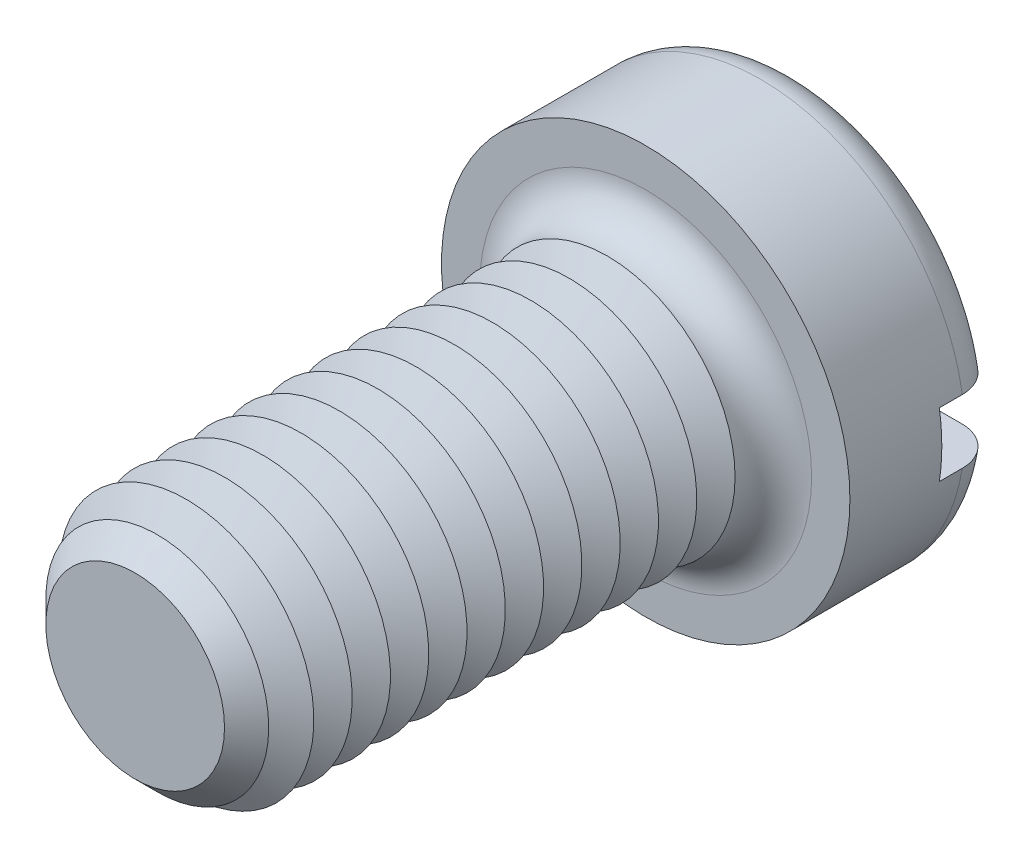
ISO-10303-21;
HEADER;
FILE_DESCRIPTION(('STEP AP214'),'2;1');
FILE_NAME('part.step','',(''),(''),'','','');
FILE_SCHEMA(('AUTOMOTIVE_DESIGN { 1 0 10303 214 1 1 1 1 }'));
ENDSEC;
DATA;
#1=APPLICATION_CONTEXT('core data for automotive mechanical design processes');
#2=APPLICATION_PROTOCOL_DEFINITION('international standard','automotive_design',2000,#1);
#3=PRODUCT_CONTEXT('',#1,'mechanical');
#4=PRODUCT('Part','Part','',(#3));
#5=PRODUCT_RELATED_PRODUCT_CATEGORY('part','',(#4));
#6=PRODUCT_DEFINITION_FORMATION('','',#4);
#7=PRODUCT_DEFINITION_CONTEXT('part definition',#1,'design');
#8=PRODUCT_DEFINITION('design','',#6,#7);
#9=PRODUCT_DEFINITION_SHAPE('','',#8);
#10=(LENGTH_UNIT() NAMED_UNIT(*) SI_UNIT(.MILLI.,.METRE.));
#11=(NAMED_UNIT(*) PLANE_ANGLE_UNIT() SI_UNIT($,.RADIAN.));
#12=(NAMED_UNIT(*) SI_UNIT($,.STERADIAN.) SOLID_ANGLE_UNIT());
#13=UNCERTAINTY_MEASURE_WITH_UNIT(LENGTH_MEASURE(1.E-05),#10,'distance_accuracy_value','');
#14=(GEOMETRIC_REPRESENTATION_CONTEXT(3) GLOBAL_UNCERTAINTY_ASSIGNED_CONTEXT((#13)) GLOBAL_UNIT_ASSIGNED_CONTEXT((#10,
#11,#12)) REPRESENTATION_CONTEXT('',''));
#15=CARTESIAN_POINT('',(0.,0.,0.));
#16=DIRECTION('',(0.,0.,1.));
#17=DIRECTION('',(1.,0.,0.));
#18=AXIS2_PLACEMENT_3D('',#15,#16,#17);
#19=CARTESIAN_POINT('',(0.,0.,-6.));
#20=DIRECTION('',(0.,0.,1.));
#21=DIRECTION('',(1.,0.,0.));
#22=AXIS2_PLACEMENT_3D('',#19,#20,#21);
#23=PLANE('',#22);
#24=CARTESIAN_POINT('',(0.,0.,-6.));
#25=DIRECTION('',(0.,0.,1.));
#26=DIRECTION('',(1.,0.,0.));
#27=AXIS2_PLACEMENT_3D('',#24,#25,#26);
#28=CIRCLE('',#27,6.5);
#29=CARTESIAN_POINT('',(-6.37867541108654,1.25,-6.));
#30=VERTEX_POINT('',#29);
#31=CARTESIAN_POINT('',(6.37867541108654,1.25,-6.));
#32=VERTEX_POINT('',#31);
#33=EDGE_CURVE('E116',#30,#32,#28,.F.);
#34=ORIENTED_EDGE('',*,*,#33,.T.);
#35=DIRECTION('',(1.,0.,0.));
#36=VECTOR('',#35,1.);
#37=CARTESIAN_POINT('',(-8.,1.25,-6.));
#38=LINE('',#37,#36);
#39=EDGE_CURVE('E111',#30,#32,#38,.T.);
#40=ORIENTED_EDGE('',*,*,#39,.F.);
#41=EDGE_LOOP('',(#34,#40));
#42=FACE_BOUND('',#41,.T.);
#43=ADVANCED_FACE('F39',(#42),#23,.F.);
#44=CARTESIAN_POINT('',(0.,0.,-4.5));
#45=DIRECTION('',(0.,0.,1.));
#46=DIRECTION('',(1.,0.,0.));
#47=AXIS2_PLACEMENT_3D('',#44,#45,#46);
#48=TOROIDAL_SURFACE('',#47,6.5,1.5);
#49=CARTESIAN_POINT('',(-7.63778128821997,1.25,-5.34492908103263));
#50=CARTESIAN_POINT('',(-7.58949199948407,1.25,-5.41482553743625));
#51=CARTESIAN_POINT('',(-7.53520056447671,1.25,-5.48065698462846));
#52=CARTESIAN_POINT('',(-7.41624971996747,1.25,-5.60228223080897));
#53=CARTESIAN_POINT('',(-7.35157642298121,1.25,-5.65806236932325));
#54=CARTESIAN_POINT('',(-7.21387612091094,1.25,-5.75795436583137));
#55=CARTESIAN_POINT('',(-7.14085828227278,1.25,-5.80207885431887));
#56=CARTESIAN_POINT('',(-6.98853766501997,1.25,-5.87758013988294));
#57=CARTESIAN_POINT('',(-6.90923642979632,1.25,-5.90896005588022));
#58=CARTESIAN_POINT('',(-6.74565677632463,1.25,-5.95849861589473));
#59=CARTESIAN_POINT('',(-6.66133328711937,1.25,-5.97650838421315));
#60=CARTESIAN_POINT('',(-6.49086565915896,1.25,-5.99833509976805));
#61=CARTESIAN_POINT('',(-6.40472129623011,1.25,-6.00215028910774));
#62=CARTESIAN_POINT('',(-6.23174891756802,1.25,-5.99550457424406));
#63=CARTESIAN_POINT('',(-6.14492874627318,1.25,-5.98483870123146));
#64=CARTESIAN_POINT('',(-5.97427268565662,1.25,-5.94920077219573));
#65=CARTESIAN_POINT('',(-5.89043699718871,1.25,-5.92422775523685));
#66=CARTESIAN_POINT('',(-5.72747580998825,1.25,-5.86041051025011));
#67=CARTESIAN_POINT('',(-5.64839123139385,1.25,-5.8214616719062));
#68=CARTESIAN_POINT('',(-5.49793182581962,1.25,-5.73076137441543));
#69=CARTESIAN_POINT('',(-5.42655700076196,1.25,-5.6790099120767));
#70=CARTESIAN_POINT('',(-5.29410028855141,1.25,-5.56444713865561));
#71=CARTESIAN_POINT('',(-5.23295591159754,1.25,-5.50170815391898));
#72=CARTESIAN_POINT('',(-5.12236155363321,1.25,-5.36664720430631));
#73=CARTESIAN_POINT('',(-5.07291010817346,1.25,-5.29432644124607));
#74=CARTESIAN_POINT('',(-4.98836421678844,1.25,-5.14389152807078));
#75=CARTESIAN_POINT('',(-4.95296843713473,1.25,-5.0659468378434));
#76=CARTESIAN_POINT('',(-4.89620356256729,1.25,-4.90510804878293));
#77=CARTESIAN_POINT('',(-4.87483169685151,1.25,-4.82221493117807));
#78=CARTESIAN_POINT('',(-4.8472995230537,1.25,-4.65636387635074));
#79=CARTESIAN_POINT('',(-4.84072446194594,1.25,-4.57347463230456));
#80=CARTESIAN_POINT('',(-4.84179430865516,1.25,-4.40779255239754));
#81=CARTESIAN_POINT('',(-4.84943782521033,1.25,-4.32499970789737));
#82=CARTESIAN_POINT('',(-4.87846819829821,1.25,-4.16301415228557));
#83=CARTESIAN_POINT('',(-4.89966978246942,1.25,-4.08378809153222));
#84=CARTESIAN_POINT('',(-4.95491528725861,1.25,-3.92995334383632));
#85=CARTESIAN_POINT('',(-4.98895983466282,1.25,-3.85534488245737));
#86=CARTESIAN_POINT('',(-5.06928242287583,1.25,-3.71183790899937));
#87=CARTESIAN_POINT('',(-5.11570495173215,1.25,-3.64302036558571));
#88=CARTESIAN_POINT('',(-5.21915370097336,1.25,-3.51388372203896));
#89=CARTESIAN_POINT('',(-5.27618132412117,1.25,-3.45356574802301));
#90=CARTESIAN_POINT('',(-5.40090076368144,1.25,-3.34137671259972));
#91=CARTESIAN_POINT('',(-5.46884305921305,1.25,-3.28978408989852));
#92=CARTESIAN_POINT('',(-5.61225757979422,1.25,-3.19841811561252));
#93=CARTESIAN_POINT('',(-5.68773079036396,1.25,-3.15864631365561));
#94=CARTESIAN_POINT('',(-5.84602026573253,1.25,-3.09111626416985));
#95=CARTESIAN_POINT('',(-5.92896901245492,1.25,-3.06366820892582));
#96=CARTESIAN_POINT('',(-6.09827849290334,1.25,-3.02294686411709));
#97=CARTESIAN_POINT('',(-6.18463944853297,1.25,-3.00967449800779));
#98=CARTESIAN_POINT('',(-6.35914138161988,1.25,-2.99765063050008));
#99=CARTESIAN_POINT('',(-6.4472913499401,1.25,-2.99902877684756));
#100=CARTESIAN_POINT('',(-6.62209547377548,1.25,-3.01665363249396));
#101=CARTESIAN_POINT('',(-6.70874965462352,1.25,-3.03290008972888));
#102=CARTESIAN_POINT('',(-6.87754008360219,1.25,-3.07975247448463));
#103=CARTESIAN_POINT('',(-6.95969991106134,1.25,-3.11027336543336));
#104=CARTESIAN_POINT('',(-7.11762200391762,1.25,-3.18486653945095));
#105=CARTESIAN_POINT('',(-7.19338469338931,1.25,-3.22893792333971));
#106=CARTESIAN_POINT('',(-7.33522754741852,1.25,-3.32873457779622));
#107=CARTESIAN_POINT('',(-7.40142768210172,1.25,-3.38428930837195));
#108=CARTESIAN_POINT('',(-7.52338344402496,1.25,-3.50587739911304));
#109=CARTESIAN_POINT('',(-7.5791399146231,1.25,-3.57190991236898));
#110=CARTESIAN_POINT('',(-7.67774856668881,1.25,-3.71151097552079));
#111=CARTESIAN_POINT('',(-7.72078137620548,1.25,-3.7849519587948));
#112=CARTESIAN_POINT('',(-7.79373860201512,1.25,-3.93807617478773));
#113=CARTESIAN_POINT('',(-7.82366445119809,1.25,-4.01775872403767));
#114=CARTESIAN_POINT('',(-7.86922494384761,1.25,-4.1801114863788));
#115=CARTESIAN_POINT('',(-7.88502105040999,1.25,-4.26273642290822));
#116=CARTESIAN_POINT('',(-7.90243332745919,1.25,-4.42948977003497));
#117=CARTESIAN_POINT('',(-7.90404643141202,1.25,-4.51361850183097));
#118=CARTESIAN_POINT('',(-7.89306914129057,1.25,-4.68049925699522));
#119=CARTESIAN_POINT('',(-7.88055163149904,1.25,-4.76325613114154));
#120=CARTESIAN_POINT('',(-7.84181179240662,1.25,-4.92542124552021));
#121=CARTESIAN_POINT('',(-7.81560657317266,1.25,-5.00483353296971));
#122=CARTESIAN_POINT('',(-7.76329893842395,1.25,-5.12766777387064));
#123=CARTESIAN_POINT('',(-7.74127773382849,1.25,-5.17287245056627));
#124=CARTESIAN_POINT('',(-7.69279783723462,1.25,-5.26083500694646));
#125=CARTESIAN_POINT('',(-7.66633917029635,1.25,-5.30359290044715));
#126=CARTESIAN_POINT('',(-7.63778128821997,1.25,-5.34492908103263));
#127=B_SPLINE_CURVE_WITH_KNOTS('',3,(#49,#50,#51,#52,#53,#54,#55,#56,#57,#58,#59,#60,#61,#62,
#63,#64,#65,#66,#67,#68,#69,#70,#71,#72,#73,#74,#75,#76,#77,#78,#79,#80,#81,#82,#83,#84,#85,#86,
#87,#88,#89,#90,#91,#92,#93,#94,#95,#96,#97,#98,#99,#100,#101,#102,#103,#104,#105,#106,#107,
#108,#109,#110,#111,#112,#113,#114,#115,#116,#117,#118,#119,#120,#121,#122,#123,#124,#125,#126),
.UNSPECIFIED.,.T.,.F.,(4,2,2,2,2,2,2,2,2,2,2,2,2,2,2,2,2,2,2,2,2,2,2,2,2,2,2,2,2,2,2,2,2,2,2,2,
2,2,4),(0.,0.254678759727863,0.509701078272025,0.764445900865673,1.01912834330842,
1.27660578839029,1.53411511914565,1.7953075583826,2.05651754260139,2.31972495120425,
2.58293242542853,2.84446831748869,3.10597143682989,3.36151874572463,3.61701554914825,
3.86525656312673,4.11347328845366,4.35836855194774,4.60327576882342,4.8511774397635,
5.0991119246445,5.35387584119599,5.60867314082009,5.86956650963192,6.13047687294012,
6.39369803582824,6.65691473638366,6.91858297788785,7.18023385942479,7.43824706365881,
7.69623942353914,7.95037087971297,8.20447454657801,8.45563599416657,8.70685174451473,
8.95677764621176,9.20639187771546,9.35700761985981,9.50762251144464),.UNSPECIFIED.);
#128=CARTESIAN_POINT('',(-7.90174031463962,1.25,-4.50000000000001));
#129=VERTEX_POINT('',#128);
#130=EDGE_CURVE('E281',#129,#30,#127,.T.);
#131=ORIENTED_EDGE('',*,*,#130,.F.);
#132=CARTESIAN_POINT('',(0.,0.,-4.5));
#133=DIRECTION('',(0.,0.,1.));
#134=DIRECTION('',(1.,0.,0.));
#135=AXIS2_PLACEMENT_3D('',#132,#133,#134);
#136=CIRCLE('',#135,8.);
#137=CARTESIAN_POINT('',(7.90174031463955,1.25,-4.5));
#138=VERTEX_POINT('',#137);
#139=EDGE_CURVE('E125',#138,#129,#136,.T.);
#140=ORIENTED_EDGE('',*,*,#139,.F.);
#141=CARTESIAN_POINT('',(4.95236709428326,1.25,-5.05808354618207));
#142=CARTESIAN_POINT('',(4.98477386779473,1.25,-5.13646278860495));
#143=CARTESIAN_POINT('',(5.02397623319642,1.25,-5.21210974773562));
#144=CARTESIAN_POINT('',(5.11464829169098,1.25,-5.35575180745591));
#145=CARTESIAN_POINT('',(5.16613670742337,1.25,-5.42373499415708));
#146=CARTESIAN_POINT('',(5.27963080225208,1.25,-5.55005899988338));
#147=CARTESIAN_POINT('',(5.34161871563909,1.25,-5.60841578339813));
#148=CARTESIAN_POINT('',(5.47431803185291,1.25,-5.71412381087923));
#149=CARTESIAN_POINT('',(5.545027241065,1.25,-5.76147781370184));
#150=CARTESIAN_POINT('',(5.69469818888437,1.25,-5.84486022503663));
#151=CARTESIAN_POINT('',(5.77379661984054,1.25,-5.88064336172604));
#152=CARTESIAN_POINT('',(5.93682776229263,1.25,-5.93863952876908));
#153=CARTESIAN_POINT('',(6.02076112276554,1.25,-5.96085073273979));
#154=CARTESIAN_POINT('',(6.19235911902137,1.25,-5.99130732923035));
#155=CARTESIAN_POINT('',(6.2800597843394,1.25,-5.99935025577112));
#156=CARTESIAN_POINT('',(6.45556807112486,1.25,-6.00057400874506));
#157=CARTESIAN_POINT('',(6.54337569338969,1.25,-5.99375472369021));
#158=CARTESIAN_POINT('',(6.71642471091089,1.25,-5.96539034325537));
#159=CARTESIAN_POINT('',(6.8016703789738,1.25,-5.94387137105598));
#160=CARTESIAN_POINT('',(6.96726399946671,1.25,-5.8866508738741));
#161=CARTESIAN_POINT('',(7.04761223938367,1.25,-5.85095018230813));
#162=CARTESIAN_POINT('',(7.2000703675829,1.25,-5.7668235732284));
#163=CARTESIAN_POINT('',(7.27226868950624,1.25,-5.71855796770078));
#164=CARTESIAN_POINT('',(7.40737382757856,1.25,-5.61041520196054));
#165=CARTESIAN_POINT('',(7.47028138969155,1.25,-5.55053897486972));
#166=CARTESIAN_POINT('',(7.5840004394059,1.25,-5.42185995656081));
#167=CARTESIAN_POINT('',(7.63498189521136,1.25,-5.35320736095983));
#168=CARTESIAN_POINT('',(7.72451646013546,1.25,-5.20822613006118));
#169=CARTESIAN_POINT('',(7.76307051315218,1.25,-5.13189807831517));
#170=CARTESIAN_POINT('',(7.82615156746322,1.25,-4.97479919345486));
#171=CARTESIAN_POINT('',(7.85085353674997,1.25,-4.89409858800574));
#172=CARTESIAN_POINT('',(7.88624162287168,1.25,-4.72968126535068));
#173=CARTESIAN_POINT('',(7.89692844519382,1.25,-4.64596470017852));
#174=CARTESIAN_POINT('',(7.90393395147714,1.25,-4.47857496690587));
#175=CARTESIAN_POINT('',(7.900361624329,1.25,-4.39490633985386));
#176=CARTESIAN_POINT('',(7.8792027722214,1.25,-4.22936201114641));
#177=CARTESIAN_POINT('',(7.86161649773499,1.25,-4.14748627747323));
#178=CARTESIAN_POINT('',(7.81298565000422,1.25,-3.98793539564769));
#179=CARTESIAN_POINT('',(7.78195585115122,1.25,-3.91025574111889));
#180=CARTESIAN_POINT('',(7.70736418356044,1.25,-3.76116938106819));
#181=CARTESIAN_POINT('',(7.66380211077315,1.25,-3.68976277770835));
#182=CARTESIAN_POINT('',(7.56515173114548,1.25,-3.55480889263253));
#183=CARTESIAN_POINT('',(7.51000119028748,1.25,-3.49130712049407));
#184=CARTESIAN_POINT('',(7.38992820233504,1.25,-3.3743390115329));
#185=CARTESIAN_POINT('',(7.32500529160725,1.25,-3.32087315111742));
#186=CARTESIAN_POINT('',(7.18646521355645,1.25,-3.22483712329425));
#187=CARTESIAN_POINT('',(7.11275872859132,1.25,-3.18239583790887));
#188=CARTESIAN_POINT('',(6.95934489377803,1.25,-3.11028530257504));
#189=CARTESIAN_POINT('',(6.87963710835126,1.25,-3.08061698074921));
#190=CARTESIAN_POINT('',(6.71523243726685,1.25,-3.03442872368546));
#191=CARTESIAN_POINT('',(6.63047940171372,1.25,-3.0181086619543));
#192=CARTESIAN_POINT('',(6.45944163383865,1.25,-2.99971307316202));
#193=CARTESIAN_POINT('',(6.37315677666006,1.25,-2.99763871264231));
#194=CARTESIAN_POINT('',(6.20021063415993,1.25,-3.00779604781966));
#195=CARTESIAN_POINT('',(6.11356117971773,1.25,-3.02022976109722));
#196=CARTESIAN_POINT('',(5.94354092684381,1.25,-3.05935975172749));
#197=CARTESIAN_POINT('',(5.86017035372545,1.25,-3.08605700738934));
#198=CARTESIAN_POINT('',(5.69848536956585,1.25,-3.15322746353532));
#199=CARTESIAN_POINT('',(5.62021039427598,1.25,-3.1937956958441));
#200=CARTESIAN_POINT('',(5.47164170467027,1.25,-3.28758816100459));
#201=CARTESIAN_POINT('',(5.40134797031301,1.25,-3.3408123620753));
#202=CARTESIAN_POINT('',(5.27136483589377,1.25,-3.45806317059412));
#203=CARTESIAN_POINT('',(5.21160120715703,1.25,-3.52200740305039));
#204=CARTESIAN_POINT('',(5.10396941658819,1.25,-3.65922833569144));
#205=CARTESIAN_POINT('',(5.05609917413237,1.25,-3.73250340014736));
#206=CARTESIAN_POINT('',(4.97487058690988,1.25,-3.8844714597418));
#207=CARTESIAN_POINT('',(4.94119529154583,1.25,-3.96299495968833));
#208=CARTESIAN_POINT('',(4.88793322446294,1.25,-4.12470694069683));
#209=CARTESIAN_POINT('',(4.86834741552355,1.25,-4.20789574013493));
#210=CARTESIAN_POINT('',(4.84433446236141,1.25,-4.3740749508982));
#211=CARTESIAN_POINT('',(4.83950391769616,1.25,-4.45700748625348));
#212=CARTESIAN_POINT('',(4.84404021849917,1.25,-4.62240731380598));
#213=CARTESIAN_POINT('',(4.85338770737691,1.25,-4.70487508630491));
#214=CARTESIAN_POINT('',(4.87895619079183,1.25,-4.83246978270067));
#215=CARTESIAN_POINT('',(4.89056704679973,1.25,-4.87856970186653));
#216=CARTESIAN_POINT('',(4.91819711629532,1.25,-4.96942661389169));
#217=CARTESIAN_POINT('',(4.93421619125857,1.25,-5.01418364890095));
#218=CARTESIAN_POINT('',(4.95236709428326,1.25,-5.05808354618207));
#219=B_SPLINE_CURVE_WITH_KNOTS('',3,(#141,#142,#143,#144,#145,#146,#147,#148,#149,#150,#151,
#152,#153,#154,#155,#156,#157,#158,#159,#160,#161,#162,#163,#164,#165,#166,#167,#168,#169,#170,
#171,#172,#173,#174,#175,#176,#177,#178,#179,#180,#181,#182,#183,#184,#185,#186,#187,#188,#189,
#190,#191,#192,#193,#194,#195,#196,#197,#198,#199,#200,#201,#202,#203,#204,#205,#206,#207,#208,
#209,#210,#211,#212,#213,#214,#215,#216,#217,#218),.UNSPECIFIED.,.T.,.F.,(4,2,2,2,2,2,2,2,2,2,2,
2,2,2,2,2,2,2,2,2,2,2,2,2,2,2,2,2,2,2,2,2,2,2,2,2,2,2,4),(0.,0.25426396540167,0.508917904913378,
0.763145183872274,1.01730864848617,1.27655188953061,1.53583000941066,1.79878406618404,
2.06174009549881,2.32423003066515,2.5867045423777,2.84598168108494,3.10523799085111,
3.36053725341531,3.61581712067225,3.8677953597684,4.11976091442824,4.36980428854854,
4.61984319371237,4.86960800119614,5.11937687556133,5.37052303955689,5.62168112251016,
5.87565515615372,6.12964764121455,6.38737709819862,6.64512765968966,6.90651052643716,
7.16791132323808,7.43114013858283,7.69436829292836,7.95565940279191,8.21690477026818,
8.47196060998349,8.72703387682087,8.97506819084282,9.22276418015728,9.36518087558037,
9.50759309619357),.UNSPECIFIED.);
#220=EDGE_CURVE('E283',#32,#138,#219,.T.);
#221=ORIENTED_EDGE('',*,*,#220,.F.);
#222=ORIENTED_EDGE('',*,*,#33,.F.);
#223=EDGE_LOOP('',(#131,#140,#221,#222));
#224=FACE_BOUND('',#223,.T.);
#225=ADVANCED_FACE('F265',(#224),#48,.T.);
#226=CARTESIAN_POINT('',(0.,0.,-6.));
#227=DIRECTION('',(0.,0.,1.));
#228=DIRECTION('',(1.,0.,0.));
#229=AXIS2_PLACEMENT_3D('',#226,#227,#228);
#230=CYLINDRICAL_SURFACE('',#229,8.);
#231=DIRECTION('',(0.,0.,1.));
#232=VECTOR('',#231,1.);
#233=CARTESIAN_POINT('',(7.90174031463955,1.25,-6.));
#234=LINE('',#233,#232);
#235=CARTESIAN_POINT('',(7.90174031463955,1.25,-3.6));
#236=VERTEX_POINT('',#235);
#237=EDGE_CURVE('E299',#138,#236,#234,.T.);
#238=ORIENTED_EDGE('',*,*,#237,.F.);
#239=ORIENTED_EDGE('',*,*,#139,.T.);
#240=DIRECTION('',(0.,0.,1.));
#241=VECTOR('',#240,1.);
#242=CARTESIAN_POINT('',(-7.90174031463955,1.25,-6.));
#243=LINE('',#242,#241);
#244=CARTESIAN_POINT('',(-7.90174031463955,1.25,-3.6));
#245=VERTEX_POINT('',#244);
#246=EDGE_CURVE('E63',#245,#129,#243,.F.);
#247=ORIENTED_EDGE('',*,*,#246,.F.);
#248=CARTESIAN_POINT('',(0.,0.,-3.6));
#249=DIRECTION('',(0.,0.,-1.));
#250=DIRECTION('',(-1.,0.,0.));
#251=AXIS2_PLACEMENT_3D('',#248,#249,#250);
#252=CIRCLE('',#251,8.);
#253=CARTESIAN_POINT('',(-7.90174031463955,-1.25,-3.6));
#254=VERTEX_POINT('',#253);
#255=EDGE_CURVE('E43',#245,#254,#252,.F.);
#256=ORIENTED_EDGE('',*,*,#255,.T.);
#257=DIRECTION('',(0.,0.,1.));
#258=VECTOR('',#257,1.);
#259=CARTESIAN_POINT('',(-7.90174031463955,-1.25,-6.));
#260=LINE('',#259,#258);
#261=CARTESIAN_POINT('',(-7.9017403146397,-1.25,-4.49999999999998));
#262=VERTEX_POINT('',#261);
#263=EDGE_CURVE('E296',#262,#254,#260,.T.);
#264=ORIENTED_EDGE('',*,*,#263,.F.);
#265=CARTESIAN_POINT('',(7.90174031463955,-1.25,-4.5));
#266=VERTEX_POINT('',#265);
#267=EDGE_CURVE('E127',#262,#266,#136,.T.);
#268=ORIENTED_EDGE('',*,*,#267,.T.);
#269=DIRECTION('',(0.,0.,1.));
#270=VECTOR('',#269,1.);
#271=CARTESIAN_POINT('',(7.90174031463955,-1.25,-6.));
#272=LINE('',#271,#270);
#273=CARTESIAN_POINT('',(7.90174031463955,-1.25,-3.6));
#274=VERTEX_POINT('',#273);
#275=EDGE_CURVE('E55',#274,#266,#272,.F.);
#276=ORIENTED_EDGE('',*,*,#275,.F.);
#277=EDGE_CURVE('E11',#274,#236,#252,.F.);
#278=ORIENTED_EDGE('',*,*,#277,.T.);
#279=EDGE_LOOP('',(#238,#239,#247,#256,#264,#268,#276,#278));
#280=FACE_BOUND('',#279,.T.);
#281=CARTESIAN_POINT('',(0.,0.,0.));
#282=DIRECTION('',(0.,0.,1.));
#283=DIRECTION('',(1.,0.,0.));
#284=AXIS2_PLACEMENT_3D('',#281,#282,#283);
#285=CIRCLE('',#284,8.);
#286=CARTESIAN_POINT('',(8.,0.,0.));
#287=VERTEX_POINT('',#286);
#288=EDGE_CURVE('E302',#287,#287,#285,.T.);
#289=ORIENTED_EDGE('',*,*,#288,.F.);
#290=EDGE_LOOP('',(#289));
#291=FACE_BOUND('',#290,.T.);
#292=ADVANCED_FACE('F261',(#280,#291),#230,.T.);
#293=CARTESIAN_POINT('',(6.37867541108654,-1.25,-6.));
#294=VERTEX_POINT('',#293);
#295=CARTESIAN_POINT('',(-6.37867541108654,-1.25,-6.));
#296=VERTEX_POINT('',#295);
#297=EDGE_CURVE('E109',#294,#296,#28,.F.);
#298=ORIENTED_EDGE('',*,*,#297,.T.);
#299=DIRECTION('',(-1.,0.,0.));
#300=VECTOR('',#299,1.);
#301=CARTESIAN_POINT('',(-8.,-1.25,-6.));
#302=LINE('',#301,#300);
#303=EDGE_CURVE('E96',#294,#296,#302,.T.);
#304=ORIENTED_EDGE('',*,*,#303,.F.);
#305=EDGE_LOOP('',(#298,#304));
#306=FACE_BOUND('',#305,.T.);
#307=ADVANCED_FACE('F108',(#306),#23,.F.);
#308=CARTESIAN_POINT('',(0.,0.,0.));
#309=DIRECTION('',(0.,0.,1.));
#310=DIRECTION('',(1.,0.,0.));
#311=AXIS2_PLACEMENT_3D('',#308,#309,#310);
#312=PLANE('',#311);
#313=CARTESIAN_POINT('',(0.,0.,0.));
#314=DIRECTION('',(0.,0.,1.));
#315=DIRECTION('',(1.,0.,0.));
#316=AXIS2_PLACEMENT_3D('',#313,#314,#315);
#317=CIRCLE('',#316,6.5);
#318=CARTESIAN_POINT('',(6.5,0.,0.));
#319=VERTEX_POINT('',#318);
#320=EDGE_CURVE('E115',#319,#319,#317,.F.);
#321=ORIENTED_EDGE('',*,*,#320,.T.);
#322=EDGE_LOOP('',(#321));
#323=FACE_BOUND('',#322,.T.);
#324=ORIENTED_EDGE('',*,*,#288,.T.);
#325=EDGE_LOOP('',(#324));
#326=FACE_BOUND('',#325,.T.);
#327=ADVANCED_FACE('F260',(#323,#326),#312,.T.);
#328=CARTESIAN_POINT('',(-7.63778128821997,-1.25,-5.34492908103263));
#329=CARTESIAN_POINT('',(-7.68527581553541,-1.25,-5.27616964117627));
#330=CARTESIAN_POINT('',(-7.72703224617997,-1.25,-5.20337764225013));
#331=CARTESIAN_POINT('',(-7.79778035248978,-1.25,-5.05176511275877));
#332=CARTESIAN_POINT('',(-7.82675823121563,-1.25,-4.97293817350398));
#333=CARTESIAN_POINT('',(-7.87103239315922,-1.25,-4.81153865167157));
#334=CARTESIAN_POINT('',(-7.8863313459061,-1.25,-4.72896680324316));
#335=CARTESIAN_POINT('',(-7.90278562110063,-1.25,-4.56244566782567));
#336=CARTESIAN_POINT('',(-7.90394420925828,-1.25,-4.4784967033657));
#337=CARTESIAN_POINT('',(-7.89211470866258,-1.25,-4.31190980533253));
#338=CARTESIAN_POINT('',(-7.87917806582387,-1.25,-4.22926821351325));
#339=CARTESIAN_POINT('',(-7.8396278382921,-1.25,-4.06732477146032));
#340=CARTESIAN_POINT('',(-7.81301388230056,-1.25,-3.98802301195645));
#341=CARTESIAN_POINT('',(-7.74686575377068,-1.25,-3.83490116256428));
#342=CARTESIAN_POINT('',(-7.70731700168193,-1.25,-3.76108737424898));
#343=CARTESIAN_POINT('',(-7.61647675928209,-1.25,-3.62108231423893));
#344=CARTESIAN_POINT('',(-7.56518496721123,-1.25,-3.55489123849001));
#345=CARTESIAN_POINT('',(-7.45192141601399,-1.25,-3.43145488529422));
#346=CARTESIAN_POINT('',(-7.3898717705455,-1.25,-3.37428109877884));
#347=CARTESIAN_POINT('',(-7.25715883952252,-1.25,-3.27100737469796));
#348=CARTESIAN_POINT('',(-7.18649507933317,-1.25,-3.22490804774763));
#349=CARTESIAN_POINT('',(-7.03760898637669,-1.25,-3.14445316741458));
#350=CARTESIAN_POINT('',(-6.95930204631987,-1.25,-3.1102542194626));
#351=CARTESIAN_POINT('',(-6.79811453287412,-1.25,-3.05526915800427));
#352=CARTESIAN_POINT('',(-6.71523359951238,-1.25,-3.03448410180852));
#353=CARTESIAN_POINT('',(-6.5459165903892,-1.25,-3.006592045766));
#354=CARTESIAN_POINT('',(-6.45944575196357,-1.25,-2.99969602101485));
#355=CARTESIAN_POINT('',(-6.28655568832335,-1.25,-3.00032465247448));
#356=CARTESIAN_POINT('',(-6.20013646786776,-1.25,-3.00785047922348));
#357=CARTESIAN_POINT('',(-6.02865505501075,-1.25,-3.03725742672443));
#358=CARTESIAN_POINT('',(-5.94362352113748,-1.25,-3.05931758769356));
#359=CARTESIAN_POINT('',(-5.77844448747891,-1.25,-3.11735373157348));
#360=CARTESIAN_POINT('',(-5.69829723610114,-1.25,-3.15333042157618));
#361=CARTESIAN_POINT('',(-5.54495924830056,-1.25,-3.23837037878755));
#362=CARTESIAN_POINT('',(-5.47178958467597,-1.25,-3.28747168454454));
#363=CARTESIAN_POINT('',(-5.33486536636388,-1.25,-3.39741183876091));
#364=CARTESIAN_POINT('',(-5.27111040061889,-1.25,-3.45825017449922));
#365=CARTESIAN_POINT('',(-5.15579778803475,-1.25,-3.58914722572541));
#366=CARTESIAN_POINT('',(-5.10409113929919,-1.25,-3.65907455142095));
#367=CARTESIAN_POINT('',(-5.01353659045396,-1.25,-3.8068142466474));
#368=CARTESIAN_POINT('',(-4.97468647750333,-1.25,-3.88462525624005));
#369=CARTESIAN_POINT('',(-4.91208858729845,-1.25,-4.04366636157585));
#370=CARTESIAN_POINT('',(-4.88795969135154,-1.25,-4.12474643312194));
#371=CARTESIAN_POINT('',(-4.85404909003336,-1.25,-4.28985038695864));
#372=CARTESIAN_POINT('',(-4.84426486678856,-1.25,-4.37387374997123));
#373=CARTESIAN_POINT('',(-4.83946276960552,-1.25,-4.54023897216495));
#374=CARTESIAN_POINT('',(-4.8440833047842,-1.25,-4.62257060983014));
#375=CARTESIAN_POINT('',(-4.86713763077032,-1.25,-4.78527148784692));
#376=CARTESIAN_POINT('',(-4.88557092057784,-1.25,-4.86564079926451));
#377=CARTESIAN_POINT('',(-4.9355229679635,-1.25,-5.02189555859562));
#378=CARTESIAN_POINT('',(-4.9669975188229,-1.25,-5.09779517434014));
#379=CARTESIAN_POINT('',(-5.04199393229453,-1.25,-5.24338322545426));
#380=CARTESIAN_POINT('',(-5.0855168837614,-1.25,-5.31307109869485));
#381=CARTESIAN_POINT('',(-5.18427540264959,-1.25,-5.44580979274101));
#382=CARTESIAN_POINT('',(-5.2397318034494,-1.25,-5.50869620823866));
#383=CARTESIAN_POINT('',(-5.36015301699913,-1.25,-5.62458635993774));
#384=CARTESIAN_POINT('',(-5.42511919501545,-1.25,-5.67758867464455));
#385=CARTESIAN_POINT('',(-5.56469412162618,-1.25,-5.7737610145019));
#386=CARTESIAN_POINT('',(-5.6395232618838,-1.25,-5.81661133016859));
#387=CARTESIAN_POINT('',(-5.79521544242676,-1.25,-5.8894110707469));
#388=CARTESIAN_POINT('',(-5.8760791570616,-1.25,-5.91935905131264));
#389=CARTESIAN_POINT('',(-6.04317815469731,-1.25,-5.9660059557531));
#390=CARTESIAN_POINT('',(-6.12948555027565,-1.25,-5.98244700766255));
#391=CARTESIAN_POINT('',(-6.30363462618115,-1.25,-6.00064866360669));
#392=CARTESIAN_POINT('',(-6.39147629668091,-1.25,-6.00240936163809));
#393=CARTESIAN_POINT('',(-6.5664192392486,-1.25,-5.9911248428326));
#394=CARTESIAN_POINT('',(-6.653518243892,-1.25,-5.9780442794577));
#395=CARTESIAN_POINT('',(-6.82426167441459,-1.25,-5.93729204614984));
#396=CARTESIAN_POINT('',(-6.90790538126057,-1.25,-5.90961735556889));
#397=CARTESIAN_POINT('',(-7.06846412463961,-1.25,-5.84071272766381));
#398=CARTESIAN_POINT('',(-7.14543542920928,-1.25,-5.79961377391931));
#399=CARTESIAN_POINT('',(-7.29116896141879,-1.25,-5.70491210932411));
#400=CARTESIAN_POINT('',(-7.35994165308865,-1.25,-5.65132560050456));
#401=CARTESIAN_POINT('',(-7.46362894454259,-1.25,-5.55509815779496));
#402=CARTESIAN_POINT('',(-7.50165191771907,-1.25,-5.51575032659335));
#403=CARTESIAN_POINT('',(-7.57319530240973,-1.25,-5.43315308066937));
#404=CARTESIAN_POINT('',(-7.60671575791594,-1.25,-5.38990370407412));
#405=CARTESIAN_POINT('',(-7.63778128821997,-1.25,-5.34492908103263));
#406=B_SPLINE_CURVE_WITH_KNOTS('',3,(#328,#329,#330,#331,#332,#333,#334,#335,#336,#337,#338,
#339,#340,#341,#342,#343,#344,#345,#346,#347,#348,#349,#350,#351,#352,#353,#354,#355,#356,#357,
#358,#359,#360,#361,#362,#363,#364,#365,#366,#367,#368,#369,#370,#371,#372,#373,#374,#375,#376,
#377,#378,#379,#380,#381,#382,#383,#384,#385,#386,#387,#388,#389,#390,#391,#392,#393,#394,#395,
#396,#397,#398,#399,#400,#401,#402,#403,#404,#405),.UNSPECIFIED.,.T.,.F.,(4,2,2,2,2,2,2,2,2,2,2,
2,2,2,2,2,2,2,2,2,2,2,2,2,2,2,2,2,2,2,2,2,2,2,2,2,2,2,4),(0.,0.250506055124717,
0.501281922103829,0.752008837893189,1.00267784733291,1.25243500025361,1.50219893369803,
1.75224536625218,2.00229822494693,2.25424343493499,2.50620253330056,2.76136198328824,
3.01654154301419,3.27556891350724,3.53461730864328,3.79691797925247,4.05923197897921,
4.32231463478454,4.5853858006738,4.84500678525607,5.10458306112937,5.3571172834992,
5.60960717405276,5.85581050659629,6.10200490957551,6.34737151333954,6.59276029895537,
6.84315522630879,7.09358613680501,7.35108485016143,7.60861238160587,7.87094926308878,
8.13328446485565,8.39624576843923,8.65926152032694,8.91978401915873,9.17997036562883,
9.34382460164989,9.50767723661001),.UNSPECIFIED.);
#407=EDGE_CURVE('E103',#296,#262,#406,.T.);
#408=ORIENTED_EDGE('',*,*,#407,.F.);
#409=ORIENTED_EDGE('',*,*,#297,.F.);
#410=CARTESIAN_POINT('',(4.95236709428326,-1.25,-5.05808354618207));
#411=CARTESIAN_POINT('',(4.92105512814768,-1.25,-4.98233216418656));
#412=CARTESIAN_POINT('',(4.89604361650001,-1.25,-4.90392040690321));
#413=CARTESIAN_POINT('',(4.85951223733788,-1.25,-4.74395758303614));
#414=CARTESIAN_POINT('',(4.8480045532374,-1.25,-4.66240375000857));
#415=CARTESIAN_POINT('',(4.83891469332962,-1.25,-4.49852199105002));
#416=CARTESIAN_POINT('',(4.84133145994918,-1.25,-4.41619412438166));
#417=CARTESIAN_POINT('',(4.8600038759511,-1.25,-4.25314313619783));
#418=CARTESIAN_POINT('',(4.87625705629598,-1.25,-4.17241973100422));
#419=CARTESIAN_POINT('',(4.92196554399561,-1.25,-4.01505032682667));
#420=CARTESIAN_POINT('',(4.95138456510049,-1.25,-3.93839376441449));
#421=CARTESIAN_POINT('',(5.02244158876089,-1.25,-3.79097367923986));
#422=CARTESIAN_POINT('',(5.06408092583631,-1.25,-3.72021080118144));
#423=CARTESIAN_POINT('',(5.15918188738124,-1.25,-3.5851203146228));
#424=CARTESIAN_POINT('',(5.21285223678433,-1.25,-3.5209397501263));
#425=CARTESIAN_POINT('',(5.32993512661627,-1.25,-3.40218700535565));
#426=CARTESIAN_POINT('',(5.39334903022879,-1.25,-3.34761617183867));
#427=CARTESIAN_POINT('',(5.5300552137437,-1.25,-3.24801679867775));
#428=CARTESIAN_POINT('',(5.60357647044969,-1.25,-3.20330242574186));
#429=CARTESIAN_POINT('',(5.75697062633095,-1.25,-3.1265687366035));
#430=CARTESIAN_POINT('',(5.83684424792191,-1.25,-3.09455086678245));
#431=CARTESIAN_POINT('',(6.00239031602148,-1.25,-3.04353393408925));
#432=CARTESIAN_POINT('',(6.08814636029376,-1.25,-3.02480570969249));
#433=CARTESIAN_POINT('',(6.26158564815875,-1.25,-3.00194915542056));
#434=CARTESIAN_POINT('',(6.34926896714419,-1.25,-2.997821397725));
#435=CARTESIAN_POINT('',(6.52441816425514,-1.25,-3.00435236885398));
#436=CARTESIAN_POINT('',(6.61188199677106,-1.25,-3.01506655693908));
#437=CARTESIAN_POINT('',(6.78373130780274,-1.25,-3.05116556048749));
#438=CARTESIAN_POINT('',(6.8681168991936,-1.25,-3.07654983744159));
#439=CARTESIAN_POINT('',(7.03056473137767,-1.25,-3.14105639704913));
#440=CARTESIAN_POINT('',(7.10867812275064,-1.25,-3.18004978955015));
#441=CARTESIAN_POINT('',(7.25711285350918,-1.25,-3.27078804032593));
#442=CARTESIAN_POINT('',(7.327434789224,-1.25,-3.32253192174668));
#443=CARTESIAN_POINT('',(7.45716954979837,-1.25,-3.4364775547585));
#444=CARTESIAN_POINT('',(7.51672925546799,-1.25,-3.49851206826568));
#445=CARTESIAN_POINT('',(7.62440498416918,-1.25,-3.63182557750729));
#446=CARTESIAN_POINT('',(7.67252193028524,-1.25,-3.70310382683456));
#447=CARTESIAN_POINT('',(7.75523498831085,-1.25,-3.8517825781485));
#448=CARTESIAN_POINT('',(7.79001407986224,-1.25,-3.92908131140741));
#449=CARTESIAN_POINT('',(7.84595474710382,-1.25,-4.08845836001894));
#450=CARTESIAN_POINT('',(7.86711715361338,-1.25,-4.1705363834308));
#451=CARTESIAN_POINT('',(7.89503817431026,-1.25,-4.3362768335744));
#452=CARTESIAN_POINT('',(7.90193595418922,-1.25,-4.41991584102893));
#453=CARTESIAN_POINT('',(7.90153623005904,-1.25,-4.58715860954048));
#454=CARTESIAN_POINT('',(7.89423915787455,-1.25,-4.67076237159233));
#455=CARTESIAN_POINT('',(7.86572271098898,-1.25,-4.83525080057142));
#456=CARTESIAN_POINT('',(7.84455307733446,-1.25,-4.91614410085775));
#457=CARTESIAN_POINT('',(7.78897430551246,-1.25,-5.0732444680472));
#458=CARTESIAN_POINT('',(7.75456511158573,-1.25,-5.1494515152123));
#459=CARTESIAN_POINT('',(7.67339923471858,-1.25,-5.29528903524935));
#460=CARTESIAN_POINT('',(7.62660424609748,-1.25,-5.36489817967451));
#461=CARTESIAN_POINT('',(7.52209201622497,-1.25,-5.49536318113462));
#462=CARTESIAN_POINT('',(7.4643743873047,-1.25,-5.55621872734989));
#463=CARTESIAN_POINT('',(7.33909994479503,-1.25,-5.66807257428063));
#464=CARTESIAN_POINT('',(7.27145672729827,-1.25,-5.71897407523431));
#465=CARTESIAN_POINT('',(7.12868060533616,-1.25,-5.80887807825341));
#466=CARTESIAN_POINT('',(7.0535472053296,-1.25,-5.84787979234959));
#467=CARTESIAN_POINT('',(6.89682225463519,-1.25,-5.91345911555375));
#468=CARTESIAN_POINT('',(6.81515596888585,-1.25,-5.93985808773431));
#469=CARTESIAN_POINT('',(6.64858434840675,-1.25,-5.97879449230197));
#470=CARTESIAN_POINT('',(6.56367874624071,-1.25,-5.99133077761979));
#471=CARTESIAN_POINT('',(6.39168259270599,-1.25,-6.00236627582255));
#472=CARTESIAN_POINT('',(6.30457835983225,-1.25,-6.00065255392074));
#473=CARTESIAN_POINT('',(6.13186422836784,-1.25,-5.98278857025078));
#474=CARTESIAN_POINT('',(6.04625438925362,-1.25,-5.96663773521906));
#475=CARTESIAN_POINT('',(5.87802521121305,-1.25,-5.92012173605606));
#476=CARTESIAN_POINT('',(5.79544617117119,-1.25,-5.88961066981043));
#477=CARTESIAN_POINT('',(5.63656223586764,-1.25,-5.81513349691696));
#478=CARTESIAN_POINT('',(5.56025908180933,-1.25,-5.77116367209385));
#479=CARTESIAN_POINT('',(5.4162607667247,-1.25,-5.67098882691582));
#480=CARTESIAN_POINT('',(5.34855795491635,-1.25,-5.61479480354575));
#481=CARTESIAN_POINT('',(5.22382615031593,-1.25,-5.49168804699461));
#482=CARTESIAN_POINT('',(5.16678340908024,-1.25,-5.42478932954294));
#483=CARTESIAN_POINT('',(5.08326589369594,-1.25,-5.3075481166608));
#484=CARTESIAN_POINT('',(5.05313168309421,-1.25,-5.25976959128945));
#485=CARTESIAN_POINT('',(4.99845900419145,-1.25,-5.16110869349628));
#486=CARTESIAN_POINT('',(4.9739204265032,-1.25,-5.11022638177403));
#487=CARTESIAN_POINT('',(4.95236709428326,-1.25,-5.05808354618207));
#488=B_SPLINE_CURVE_WITH_KNOTS('',3,(#410,#411,#412,#413,#414,#415,#416,#417,#418,#419,#420,
#421,#422,#423,#424,#425,#426,#427,#428,#429,#430,#431,#432,#433,#434,#435,#436,#437,#438,#439,
#440,#441,#442,#443,#444,#445,#446,#447,#448,#449,#450,#451,#452,#453,#454,#455,#456,#457,#458,
#459,#460,#461,#462,#463,#464,#465,#466,#467,#468,#469,#470,#471,#472,#473,#474,#475,#476,#477,
#478,#479,#480,#481,#482,#483,#484,#485,#486,#487),.UNSPECIFIED.,.T.,.F.,(4,2,2,2,2,2,2,2,2,2,2,
2,2,2,2,2,2,2,2,2,2,2,2,2,2,2,2,2,2,2,2,2,2,2,2,2,2,2,4),(0.,0.245701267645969,
0.491624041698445,0.737528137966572,0.983388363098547,1.22857510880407,1.47378864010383,
1.72364048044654,1.97352730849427,2.2304941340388,2.48749022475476,2.74958408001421,
3.01168820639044,3.2747743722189,3.53785088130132,3.79850056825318,4.05913029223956,
4.31587819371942,4.57260537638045,4.82567253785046,5.07872425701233,5.32929532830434,
5.57985877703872,5.82952869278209,6.07919966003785,6.32965199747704,6.58011322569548,
6.8329006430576,7.08570479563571,7.3419930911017,7.59830259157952,7.85844887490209,
8.11860548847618,8.38146435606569,8.64439590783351,8.90709189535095,9.16944670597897,
9.33857644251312,9.5077028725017),.UNSPECIFIED.);
#489=EDGE_CURVE('E92',#266,#294,#488,.T.);
#490=ORIENTED_EDGE('',*,*,#489,.F.);
#491=ORIENTED_EDGE('',*,*,#267,.F.);
#492=EDGE_LOOP('',(#408,#409,#490,#491));
#493=FACE_BOUND('',#492,.T.);
#494=ADVANCED_FACE('F113',(#493),#48,.T.);
#495=CARTESIAN_POINT('',(0.,0.,1.5));
#496=DIRECTION('',(0.,0.,1.));
#497=DIRECTION('',(1.,0.,0.));
#498=AXIS2_PLACEMENT_3D('',#495,#496,#497);
#499=TOROIDAL_SURFACE('',#498,6.5,1.5);
#500=ORIENTED_EDGE('',*,*,#320,.F.);
#501=EDGE_LOOP('',(#500));
#502=FACE_BOUND('',#501,.T.);
#503=CARTESIAN_POINT('',(0.,0.,1.5));
#504=DIRECTION('',(0.,0.,-1.));
#505=DIRECTION('',(-1.,0.,0.));
#506=AXIS2_PLACEMENT_3D('',#503,#504,#505);
#507=CIRCLE('',#506,5.);
#508=CARTESIAN_POINT('',(-5.,0.,1.5));
#509=VERTEX_POINT('',#508);
#510=EDGE_CURVE('E306',#509,#509,#507,.T.);
#511=ORIENTED_EDGE('',*,*,#510,.T.);
#512=EDGE_LOOP('',(#511));
#513=FACE_BOUND('',#512,.T.);
#514=ADVANCED_FACE('F253',(#502,#513),#499,.F.);
#515=CARTESIAN_POINT('',(0.,0.,2.25));
#516=DIRECTION('',(0.,0.,-1.));
#517=DIRECTION('',(-1.,0.,0.));
#518=AXIS2_PLACEMENT_3D('',#515,#516,#517);
#519=CONICAL_SURFACE('',#518,3.70096189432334,1.0471975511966);
#520=ORIENTED_EDGE('',*,*,#510,.F.);
#521=EDGE_LOOP('',(#520));
#522=FACE_BOUND('',#521,.T.);
#523=CARTESIAN_POINT('',(0.,0.,2.25));
#524=DIRECTION('',(0.,0.,-1.));
#525=DIRECTION('',(-1.,0.,0.));
#526=AXIS2_PLACEMENT_3D('',#523,#524,#525);
#527=CIRCLE('',#526,3.70096189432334);
#528=CARTESIAN_POINT('',(-3.70096189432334,0.,2.25));
#529=VERTEX_POINT('',#528);
#530=EDGE_CURVE('E312',#529,#529,#527,.T.);
#531=ORIENTED_EDGE('',*,*,#530,.T.);
#532=EDGE_LOOP('',(#531));
#533=FACE_BOUND('',#532,.T.);
#534=ADVANCED_FACE('F249',(#522,#533),#519,.T.);
#535=CARTESIAN_POINT('',(0.,0.,3.));
#536=DIRECTION('',(0.,0.,1.));
#537=DIRECTION('',(1.,0.,0.));
#538=AXIS2_PLACEMENT_3D('',#535,#536,#537);
#539=CONICAL_SURFACE('',#538,5.,1.0471975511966);
#540=ORIENTED_EDGE('',*,*,#530,.F.);
#541=EDGE_LOOP('',(#540));
#542=FACE_BOUND('',#541,.T.);
#543=CARTESIAN_POINT('',(0.,0.,3.));
#544=DIRECTION('',(0.,0.,-1.));
#545=DIRECTION('',(-1.,0.,0.));
#546=AXIS2_PLACEMENT_3D('',#543,#544,#545);
#547=CIRCLE('',#546,5.);
#548=CARTESIAN_POINT('',(-5.,0.,3.));
#549=VERTEX_POINT('',#548);
#550=EDGE_CURVE('E318',#549,#549,#547,.T.);
#551=ORIENTED_EDGE('',*,*,#550,.T.);
#552=EDGE_LOOP('',(#551));
#553=FACE_BOUND('',#552,.T.);
#554=ADVANCED_FACE('F245',(#542,#553),#539,.T.);
#555=CARTESIAN_POINT('',(0.,0.,3.75));
#556=DIRECTION('',(0.,0.,-1.));
#557=DIRECTION('',(-1.,0.,0.));
#558=AXIS2_PLACEMENT_3D('',#555,#556,#557);
#559=CONICAL_SURFACE('',#558,3.70096189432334,1.0471975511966);
#560=ORIENTED_EDGE('',*,*,#550,.F.);
#561=EDGE_LOOP('',(#560));
#562=FACE_BOUND('',#561,.T.);
#563=CARTESIAN_POINT('',(0.,0.,3.75));
#564=DIRECTION('',(0.,0.,-1.));
#565=DIRECTION('',(-1.,0.,0.));
#566=AXIS2_PLACEMENT_3D('',#563,#564,#565);
#567=CIRCLE('',#566,3.70096189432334);
#568=CARTESIAN_POINT('',(-3.70096189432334,0.,3.75));
#569=VERTEX_POINT('',#568);
#570=EDGE_CURVE('E322',#569,#569,#567,.T.);
#571=ORIENTED_EDGE('',*,*,#570,.T.);
#572=EDGE_LOOP('',(#571));
#573=FACE_BOUND('',#572,.T.);
#574=ADVANCED_FACE('F241',(#562,#573),#559,.T.);
#575=CARTESIAN_POINT('',(0.,0.,4.5));
#576=DIRECTION('',(0.,0.,1.));
#577=DIRECTION('',(1.,0.,0.));
#578=AXIS2_PLACEMENT_3D('',#575,#576,#577);
#579=CONICAL_SURFACE('',#578,5.,1.0471975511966);
#580=ORIENTED_EDGE('',*,*,#570,.F.);
#581=EDGE_LOOP('',(#580));
#582=FACE_BOUND('',#581,.T.);
#583=CARTESIAN_POINT('',(0.,0.,4.5));
#584=DIRECTION('',(0.,0.,-1.));
#585=DIRECTION('',(-1.,0.,0.));
#586=AXIS2_PLACEMENT_3D('',#583,#584,#585);
#587=CIRCLE('',#586,5.);
#588=CARTESIAN_POINT('',(-5.,0.,4.5));
#589=VERTEX_POINT('',#588);
#590=EDGE_CURVE('E325',#589,#589,#587,.T.);
#591=ORIENTED_EDGE('',*,*,#590,.T.);
#592=EDGE_LOOP('',(#591));
#593=FACE_BOUND('',#592,.T.);
#594=ADVANCED_FACE('F237',(#582,#593),#579,.T.);
#595=CARTESIAN_POINT('',(0.,0.,5.25));
#596=DIRECTION('',(0.,0.,-1.));
#597=DIRECTION('',(-1.,0.,0.));
#598=AXIS2_PLACEMENT_3D('',#595,#596,#597);
#599=CONICAL_SURFACE('',#598,3.70096189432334,1.0471975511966);
#600=ORIENTED_EDGE('',*,*,#590,.F.);
#601=EDGE_LOOP('',(#600));
#602=FACE_BOUND('',#601,.T.);
#603=CARTESIAN_POINT('',(0.,0.,5.25));
#604=DIRECTION('',(0.,0.,-1.));
#605=DIRECTION('',(-1.,0.,0.));
#606=AXIS2_PLACEMENT_3D('',#603,#604,#605);
#607=CIRCLE('',#606,3.70096189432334);
#608=CARTESIAN_POINT('',(-3.70096189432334,0.,5.25));
#609=VERTEX_POINT('',#608);
#610=EDGE_CURVE('E329',#609,#609,#607,.T.);
#611=ORIENTED_EDGE('',*,*,#610,.T.);
#612=EDGE_LOOP('',(#611));
#613=FACE_BOUND('',#612,.T.);
#614=ADVANCED_FACE('F233',(#602,#613),#599,.T.);
#615=CARTESIAN_POINT('',(0.,0.,6.));
#616=DIRECTION('',(0.,0.,1.));
#617=DIRECTION('',(1.,0.,0.));
#618=AXIS2_PLACEMENT_3D('',#615,#616,#617);
#619=CONICAL_SURFACE('',#618,5.,1.0471975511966);
#620=ORIENTED_EDGE('',*,*,#610,.F.);
#621=EDGE_LOOP('',(#620));
#622=FACE_BOUND('',#621,.T.);
#623=CARTESIAN_POINT('',(0.,0.,6.));
#624=DIRECTION('',(0.,0.,-1.));
#625=DIRECTION('',(-1.,0.,0.));
#626=AXIS2_PLACEMENT_3D('',#623,#624,#625);
#627=CIRCLE('',#626,5.);
#628=CARTESIAN_POINT('',(-5.,0.,6.));
#629=VERTEX_POINT('',#628);
#630=EDGE_CURVE('E333',#629,#629,#627,.T.);
#631=ORIENTED_EDGE('',*,*,#630,.T.);
#632=EDGE_LOOP('',(#631));
#633=FACE_BOUND('',#632,.T.);
#634=ADVANCED_FACE('F229',(#622,#633),#619,.T.);
#635=CARTESIAN_POINT('',(0.,0.,6.75));
#636=DIRECTION('',(0.,0.,-1.));
#637=DIRECTION('',(-1.,0.,0.));
#638=AXIS2_PLACEMENT_3D('',#635,#636,#637);
#639=CONICAL_SURFACE('',#638,3.70096189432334,1.0471975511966);
#640=ORIENTED_EDGE('',*,*,#630,.F.);
#641=EDGE_LOOP('',(#640));
#642=FACE_BOUND('',#641,.T.);
#643=CARTESIAN_POINT('',(0.,0.,6.75));
#644=DIRECTION('',(0.,0.,-1.));
#645=DIRECTION('',(-1.,0.,0.));
#646=AXIS2_PLACEMENT_3D('',#643,#644,#645);
#647=CIRCLE('',#646,3.70096189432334);
#648=CARTESIAN_POINT('',(-3.70096189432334,0.,6.75));
#649=VERTEX_POINT('',#648);
#650=EDGE_CURVE('E337',#649,#649,#647,.T.);
#651=ORIENTED_EDGE('',*,*,#650,.T.);
#652=EDGE_LOOP('',(#651));
#653=FACE_BOUND('',#652,.T.);
#654=ADVANCED_FACE('F225',(#642,#653),#639,.T.);
#655=CARTESIAN_POINT('',(0.,0.,7.5));
#656=DIRECTION('',(0.,0.,1.));
#657=DIRECTION('',(1.,0.,0.));
#658=AXIS2_PLACEMENT_3D('',#655,#656,#657);
#659=CONICAL_SURFACE('',#658,5.,1.0471975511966);
#660=ORIENTED_EDGE('',*,*,#650,.F.);
#661=EDGE_LOOP('',(#660));
#662=FACE_BOUND('',#661,.T.);
#663=CARTESIAN_POINT('',(0.,0.,7.5));
#664=DIRECTION('',(0.,0.,-1.));
#665=DIRECTION('',(-1.,0.,0.));
#666=AXIS2_PLACEMENT_3D('',#663,#664,#665);
#667=CIRCLE('',#666,5.);
#668=CARTESIAN_POINT('',(-5.,0.,7.5));
#669=VERTEX_POINT('',#668);
#670=EDGE_CURVE('E340',#669,#669,#667,.T.);
#671=ORIENTED_EDGE('',*,*,#670,.T.);
#672=EDGE_LOOP('',(#671));
#673=FACE_BOUND('',#672,.T.);
#674=ADVANCED_FACE('F221',(#662,#673),#659,.T.);
#675=CARTESIAN_POINT('',(0.,0.,8.25));
#676=DIRECTION('',(0.,0.,-1.));
#677=DIRECTION('',(-1.,0.,0.));
#678=AXIS2_PLACEMENT_3D('',#675,#676,#677);
#679=CONICAL_SURFACE('',#678,3.70096189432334,1.0471975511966);
#680=ORIENTED_EDGE('',*,*,#670,.F.);
#681=EDGE_LOOP('',(#680));
#682=FACE_BOUND('',#681,.T.);
#683=CARTESIAN_POINT('',(0.,0.,8.25));
#684=DIRECTION('',(0.,0.,-1.));
#685=DIRECTION('',(-1.,0.,0.));
#686=AXIS2_PLACEMENT_3D('',#683,#684,#685);
#687=CIRCLE('',#686,3.70096189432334);
#688=CARTESIAN_POINT('',(-3.70096189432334,0.,8.25));
#689=VERTEX_POINT('',#688);
#690=EDGE_CURVE('E344',#689,#689,#687,.T.);
#691=ORIENTED_EDGE('',*,*,#690,.T.);
#692=EDGE_LOOP('',(#691));
#693=FACE_BOUND('',#692,.T.);
#694=ADVANCED_FACE('F217',(#682,#693),#679,.T.);
#695=CARTESIAN_POINT('',(0.,0.,9.));
#696=DIRECTION('',(0.,0.,1.));
#697=DIRECTION('',(1.,0.,0.));
#698=AXIS2_PLACEMENT_3D('',#695,#696,#697);
#699=CONICAL_SURFACE('',#698,5.,1.0471975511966);
#700=ORIENTED_EDGE('',*,*,#690,.F.);
#701=EDGE_LOOP('',(#700));
#702=FACE_BOUND('',#701,.T.);
#703=CARTESIAN_POINT('',(0.,0.,9.));
#704=DIRECTION('',(0.,0.,-1.));
#705=DIRECTION('',(-1.,0.,0.));
#706=AXIS2_PLACEMENT_3D('',#703,#704,#705);
#707=CIRCLE('',#706,5.);
#708=CARTESIAN_POINT('',(-5.,0.,9.));
#709=VERTEX_POINT('',#708);
#710=EDGE_CURVE('E348',#709,#709,#707,.T.);
#711=ORIENTED_EDGE('',*,*,#710,.T.);
#712=EDGE_LOOP('',(#711));
#713=FACE_BOUND('',#712,.T.);
#714=ADVANCED_FACE('F213',(#702,#713),#699,.T.);
#715=CARTESIAN_POINT('',(0.,0.,9.75));
#716=DIRECTION('',(0.,0.,-1.));
#717=DIRECTION('',(-1.,0.,0.));
#718=AXIS2_PLACEMENT_3D('',#715,#716,#717);
#719=CONICAL_SURFACE('',#718,3.70096189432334,1.0471975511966);
#720=ORIENTED_EDGE('',*,*,#710,.F.);
#721=EDGE_LOOP('',(#720));
#722=FACE_BOUND('',#721,.T.);
#723=CARTESIAN_POINT('',(0.,0.,9.75));
#724=DIRECTION('',(0.,0.,-1.));
#725=DIRECTION('',(-1.,0.,0.));
#726=AXIS2_PLACEMENT_3D('',#723,#724,#725);
#727=CIRCLE('',#726,3.70096189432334);
#728=CARTESIAN_POINT('',(-3.70096189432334,0.,9.75));
#729=VERTEX_POINT('',#728);
#730=EDGE_CURVE('E351',#729,#729,#727,.T.);
#731=ORIENTED_EDGE('',*,*,#730,.T.);
#732=EDGE_LOOP('',(#731));
#733=FACE_BOUND('',#732,.T.);
#734=ADVANCED_FACE('F209',(#722,#733),#719,.T.);
#735=CARTESIAN_POINT('',(0.,0.,10.5));
#736=DIRECTION('',(0.,0.,1.));
#737=DIRECTION('',(1.,0.,0.));
#738=AXIS2_PLACEMENT_3D('',#735,#736,#737);
#739=CONICAL_SURFACE('',#738,5.,1.0471975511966);
#740=ORIENTED_EDGE('',*,*,#730,.F.);
#741=EDGE_LOOP('',(#740));
#742=FACE_BOUND('',#741,.T.);
#743=CARTESIAN_POINT('',(0.,0.,10.5));
#744=DIRECTION('',(0.,0.,-1.));
#745=DIRECTION('',(-1.,0.,0.));
#746=AXIS2_PLACEMENT_3D('',#743,#744,#745);
#747=CIRCLE('',#746,5.);
#748=CARTESIAN_POINT('',(-5.,0.,10.5));
#749=VERTEX_POINT('',#748);
#750=EDGE_CURVE('E355',#749,#749,#747,.T.);
#751=ORIENTED_EDGE('',*,*,#750,.T.);
#752=EDGE_LOOP('',(#751));
#753=FACE_BOUND('',#752,.T.);
#754=ADVANCED_FACE('F205',(#742,#753),#739,.T.);
#755=CARTESIAN_POINT('',(0.,0.,11.25));
#756=DIRECTION('',(0.,0.,-1.));
#757=DIRECTION('',(-1.,0.,0.));
#758=AXIS2_PLACEMENT_3D('',#755,#756,#757);
#759=CONICAL_SURFACE('',#758,3.70096189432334,1.0471975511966);
#760=ORIENTED_EDGE('',*,*,#750,.F.);
#761=EDGE_LOOP('',(#760));
#762=FACE_BOUND('',#761,.T.);
#763=CARTESIAN_POINT('',(0.,0.,11.25));
#764=DIRECTION('',(0.,0.,-1.));
#765=DIRECTION('',(-1.,0.,0.));
#766=AXIS2_PLACEMENT_3D('',#763,#764,#765);
#767=CIRCLE('',#766,3.70096189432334);
#768=CARTESIAN_POINT('',(-3.70096189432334,0.,11.25));
#769=VERTEX_POINT('',#768);
#770=EDGE_CURVE('E359',#769,#769,#767,.T.);
#771=ORIENTED_EDGE('',*,*,#770,.T.);
#772=EDGE_LOOP('',(#771));
#773=FACE_BOUND('',#772,.T.);
#774=ADVANCED_FACE('F201',(#762,#773),#759,.T.);
#775=CARTESIAN_POINT('',(0.,0.,12.));
#776=DIRECTION('',(0.,0.,1.));
#777=DIRECTION('',(1.,0.,0.));
#778=AXIS2_PLACEMENT_3D('',#775,#776,#777);
#779=CONICAL_SURFACE('',#778,5.,1.0471975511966);
#780=ORIENTED_EDGE('',*,*,#770,.F.);
#781=EDGE_LOOP('',(#780));
#782=FACE_BOUND('',#781,.T.);
#783=CARTESIAN_POINT('',(0.,0.,12.));
#784=DIRECTION('',(0.,0.,-1.));
#785=DIRECTION('',(-1.,0.,0.));
#786=AXIS2_PLACEMENT_3D('',#783,#784,#785);
#787=CIRCLE('',#786,5.);
#788=CARTESIAN_POINT('',(-5.,0.,12.));
#789=VERTEX_POINT('',#788);
#790=EDGE_CURVE('E363',#789,#789,#787,.T.);
#791=ORIENTED_EDGE('',*,*,#790,.T.);
#792=EDGE_LOOP('',(#791));
#793=FACE_BOUND('',#792,.T.);
#794=ADVANCED_FACE('F197',(#782,#793),#779,.T.);
#795=CARTESIAN_POINT('',(0.,0.,12.75));
#796=DIRECTION('',(0.,0.,-1.));
#797=DIRECTION('',(-1.,0.,0.));
#798=AXIS2_PLACEMENT_3D('',#795,#796,#797);
#799=CONICAL_SURFACE('',#798,3.70096189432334,1.0471975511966);
#800=ORIENTED_EDGE('',*,*,#790,.F.);
#801=EDGE_LOOP('',(#800));
#802=FACE_BOUND('',#801,.T.);
#803=CARTESIAN_POINT('',(0.,0.,12.75));
#804=DIRECTION('',(0.,0.,-1.));
#805=DIRECTION('',(-1.,0.,0.));
#806=AXIS2_PLACEMENT_3D('',#803,#804,#805);
#807=CIRCLE('',#806,3.70096189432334);
#808=CARTESIAN_POINT('',(-3.70096189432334,0.,12.75));
#809=VERTEX_POINT('',#808);
#810=EDGE_CURVE('E367',#809,#809,#807,.T.);
#811=ORIENTED_EDGE('',*,*,#810,.T.);
#812=EDGE_LOOP('',(#811));
#813=FACE_BOUND('',#812,.T.);
#814=ADVANCED_FACE('F193',(#802,#813),#799,.T.);
#815=CARTESIAN_POINT('',(0.,0.,13.5));
#816=DIRECTION('',(0.,0.,1.));
#817=DIRECTION('',(1.,0.,0.));
#818=AXIS2_PLACEMENT_3D('',#815,#816,#817);
#819=CONICAL_SURFACE('',#818,5.,1.0471975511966);
#820=ORIENTED_EDGE('',*,*,#810,.F.);
#821=EDGE_LOOP('',(#820));
#822=FACE_BOUND('',#821,.T.);
#823=CARTESIAN_POINT('',(0.,0.,13.5));
#824=DIRECTION('',(0.,0.,-1.));
#825=DIRECTION('',(-1.,0.,0.));
#826=AXIS2_PLACEMENT_3D('',#823,#824,#825);
#827=CIRCLE('',#826,5.);
#828=CARTESIAN_POINT('',(-5.,0.,13.5));
#829=VERTEX_POINT('',#828);
#830=EDGE_CURVE('E370',#829,#829,#827,.T.);
#831=ORIENTED_EDGE('',*,*,#830,.T.);
#832=EDGE_LOOP('',(#831));
#833=FACE_BOUND('',#832,.T.);
#834=ADVANCED_FACE('F189',(#822,#833),#819,.T.);
#835=CARTESIAN_POINT('',(0.,0.,14.25));
#836=DIRECTION('',(0.,0.,-1.));
#837=DIRECTION('',(-1.,0.,0.));
#838=AXIS2_PLACEMENT_3D('',#835,#836,#837);
#839=CONICAL_SURFACE('',#838,3.70096189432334,1.0471975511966);
#840=ORIENTED_EDGE('',*,*,#830,.F.);
#841=EDGE_LOOP('',(#840));
#842=FACE_BOUND('',#841,.T.);
#843=CARTESIAN_POINT('',(0.,0.,14.25));
#844=DIRECTION('',(0.,0.,-1.));
#845=DIRECTION('',(-1.,0.,0.));
#846=AXIS2_PLACEMENT_3D('',#843,#844,#845);
#847=CIRCLE('',#846,3.70096189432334);
#848=CARTESIAN_POINT('',(-3.70096189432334,0.,14.25));
#849=VERTEX_POINT('',#848);
#850=EDGE_CURVE('E374',#849,#849,#847,.T.);
#851=ORIENTED_EDGE('',*,*,#850,.T.);
#852=EDGE_LOOP('',(#851));
#853=FACE_BOUND('',#852,.T.);
#854=ADVANCED_FACE('F185',(#842,#853),#839,.T.);
#855=CARTESIAN_POINT('',(0.,0.,15.));
#856=DIRECTION('',(0.,0.,1.));
#857=DIRECTION('',(1.,0.,0.));
#858=AXIS2_PLACEMENT_3D('',#855,#856,#857);
#859=CONICAL_SURFACE('',#858,5.,1.0471975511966);
#860=ORIENTED_EDGE('',*,*,#850,.F.);
#861=EDGE_LOOP('',(#860));
#862=FACE_BOUND('',#861,.T.);
#863=CARTESIAN_POINT('',(0.,0.,15.));
#864=DIRECTION('',(0.,0.,-1.));
#865=DIRECTION('',(-1.,0.,0.));
#866=AXIS2_PLACEMENT_3D('',#863,#864,#865);
#867=CIRCLE('',#866,5.);
#868=CARTESIAN_POINT('',(-5.,0.,15.));
#869=VERTEX_POINT('',#868);
#870=EDGE_CURVE('E378',#869,#869,#867,.T.);
#871=ORIENTED_EDGE('',*,*,#870,.T.);
#872=EDGE_LOOP('',(#871));
#873=FACE_BOUND('',#872,.T.);
#874=ADVANCED_FACE('F181',(#862,#873),#859,.T.);
#875=CARTESIAN_POINT('',(0.,0.,15.75));
#876=DIRECTION('',(0.,0.,-1.));
#877=DIRECTION('',(-1.,0.,0.));
#878=AXIS2_PLACEMENT_3D('',#875,#876,#877);
#879=CONICAL_SURFACE('',#878,3.70096189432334,1.0471975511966);
#880=ORIENTED_EDGE('',*,*,#870,.F.);
#881=EDGE_LOOP('',(#880));
#882=FACE_BOUND('',#881,.T.);
#883=CARTESIAN_POINT('',(0.,0.,15.75));
#884=DIRECTION('',(0.,0.,-1.));
#885=DIRECTION('',(-1.,0.,0.));
#886=AXIS2_PLACEMENT_3D('',#883,#884,#885);
#887=CIRCLE('',#886,3.70096189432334);
#888=CARTESIAN_POINT('',(-3.70096189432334,0.,15.75));
#889=VERTEX_POINT('',#888);
#890=EDGE_CURVE('E382',#889,#889,#887,.T.);
#891=ORIENTED_EDGE('',*,*,#890,.T.);
#892=EDGE_LOOP('',(#891));
#893=FACE_BOUND('',#892,.T.);
#894=ADVANCED_FACE('F177',(#882,#893),#879,.T.);
#895=CARTESIAN_POINT('',(0.,0.,16.5));
#896=DIRECTION('',(0.,0.,1.));
#897=DIRECTION('',(1.,0.,0.));
#898=AXIS2_PLACEMENT_3D('',#895,#896,#897);
#899=CONICAL_SURFACE('',#898,5.,1.0471975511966);
#900=ORIENTED_EDGE('',*,*,#890,.F.);
#901=EDGE_LOOP('',(#900));
#902=FACE_BOUND('',#901,.T.);
#903=CARTESIAN_POINT('',(0.,0.,16.5));
#904=DIRECTION('',(0.,0.,-1.));
#905=DIRECTION('',(-1.,0.,0.));
#906=AXIS2_PLACEMENT_3D('',#903,#904,#905);
#907=CIRCLE('',#906,5.);
#908=CARTESIAN_POINT('',(-5.,0.,16.5));
#909=VERTEX_POINT('',#908);
#910=EDGE_CURVE('E386',#909,#909,#907,.T.);
#911=ORIENTED_EDGE('',*,*,#910,.T.);
#912=EDGE_LOOP('',(#911));
#913=FACE_BOUND('',#912,.T.);
#914=ADVANCED_FACE('F173',(#902,#913),#899,.T.);
#915=CARTESIAN_POINT('',(0.,0.,17.25));
#916=DIRECTION('',(0.,0.,-1.));
#917=DIRECTION('',(-1.,0.,0.));
#918=AXIS2_PLACEMENT_3D('',#915,#916,#917);
#919=CONICAL_SURFACE('',#918,3.70096189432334,1.0471975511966);
#920=ORIENTED_EDGE('',*,*,#910,.F.);
#921=EDGE_LOOP('',(#920));
#922=FACE_BOUND('',#921,.T.);
#923=CARTESIAN_POINT('',(0.,0.,17.25));
#924=DIRECTION('',(0.,0.,-1.));
#925=DIRECTION('',(-1.,0.,0.));
#926=AXIS2_PLACEMENT_3D('',#923,#924,#925);
#927=CIRCLE('',#926,3.70096189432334);
#928=CARTESIAN_POINT('',(-3.70096189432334,0.,17.25));
#929=VERTEX_POINT('',#928);
#930=EDGE_CURVE('E136',#929,#929,#927,.T.);
#931=ORIENTED_EDGE('',*,*,#930,.T.);
#932=EDGE_LOOP('',(#931));
#933=FACE_BOUND('',#932,.T.);
#934=ADVANCED_FACE('F169',(#922,#933),#919,.T.);
#935=CARTESIAN_POINT('',(0.,0.,18.));
#936=DIRECTION('',(0.,0.,1.));
#937=DIRECTION('',(1.,0.,0.));
#938=AXIS2_PLACEMENT_3D('',#935,#936,#937);
#939=CONICAL_SURFACE('',#938,5.,1.0471975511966);
#940=ORIENTED_EDGE('',*,*,#930,.F.);
#941=EDGE_LOOP('',(#940));
#942=FACE_BOUND('',#941,.T.);
#943=CARTESIAN_POINT('',(0.,0.,18.));
#944=DIRECTION('',(0.,0.,-1.));
#945=DIRECTION('',(-1.,0.,0.));
#946=AXIS2_PLACEMENT_3D('',#943,#944,#945);
#947=CIRCLE('',#946,5.);
#948=CARTESIAN_POINT('',(-5.,0.,18.));
#949=VERTEX_POINT('',#948);
#950=EDGE_CURVE('E137',#949,#949,#947,.T.);
#951=ORIENTED_EDGE('',*,*,#950,.T.);
#952=EDGE_LOOP('',(#951));
#953=FACE_BOUND('',#952,.T.);
#954=ADVANCED_FACE('F165',(#942,#953),#939,.T.);
#955=CARTESIAN_POINT('',(0.,0.,18.75));
#956=DIRECTION('',(0.,0.,-1.));
#957=DIRECTION('',(-1.,0.,0.));
#958=AXIS2_PLACEMENT_3D('',#955,#956,#957);
#959=CONICAL_SURFACE('',#958,3.70096189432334,1.0471975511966);
#960=ORIENTED_EDGE('',*,*,#950,.F.);
#961=EDGE_LOOP('',(#960));
#962=FACE_BOUND('',#961,.T.);
#963=CARTESIAN_POINT('',(0.,0.,18.75));
#964=DIRECTION('',(0.,0.,-1.));
#965=DIRECTION('',(-1.,0.,0.));
#966=AXIS2_PLACEMENT_3D('',#963,#964,#965);
#967=CIRCLE('',#966,3.70096189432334);
#968=CARTESIAN_POINT('',(-3.70096189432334,0.,18.75));
#969=VERTEX_POINT('',#968);
#970=EDGE_CURVE('E396',#969,#969,#967,.T.);
#971=ORIENTED_EDGE('',*,*,#970,.T.);
#972=EDGE_LOOP('',(#971));
#973=FACE_BOUND('',#972,.T.);
#974=ADVANCED_FACE('F161',(#962,#973),#959,.T.);
#975=CARTESIAN_POINT('',(0.,0.,19.5));
#976=DIRECTION('',(0.,0.,1.));
#977=DIRECTION('',(1.,0.,0.));
#978=AXIS2_PLACEMENT_3D('',#975,#976,#977);
#979=CONICAL_SURFACE('',#978,5.,1.0471975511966);
#980=CARTESIAN_POINT('',(0.,0.,19.1339745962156));
#981=DIRECTION('',(0.,0.,1.));
#982=DIRECTION('',(1.,0.,0.));
#983=AXIS2_PLACEMENT_3D('',#980,#981,#982);
#984=CIRCLE('',#983,4.36602540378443);
#985=CARTESIAN_POINT('',(4.36602540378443,0.,19.1339745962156));
#986=VERTEX_POINT('',#985);
#987=EDGE_CURVE('E133',#986,#986,#984,.F.);
#988=ORIENTED_EDGE('',*,*,#987,.T.);
#989=EDGE_LOOP('',(#988));
#990=FACE_BOUND('',#989,.T.);
#991=ORIENTED_EDGE('',*,*,#970,.F.);
#992=EDGE_LOOP('',(#991));
#993=FACE_BOUND('',#992,.T.);
#994=ADVANCED_FACE('F156',(#990,#993),#979,.T.);
#995=CARTESIAN_POINT('',(0.,0.,20.));
#996=DIRECTION('',(0.,0.,1.));
#997=DIRECTION('',(1.,0.,0.));
#998=AXIS2_PLACEMENT_3D('',#995,#996,#997);
#999=PLANE('',#998);
#1000=CARTESIAN_POINT('',(0.,0.,20.));
#1001=DIRECTION('',(0.,0.,1.));
#1002=DIRECTION('',(1.,0.,0.));
#1003=AXIS2_PLACEMENT_3D('',#1000,#1001,#1002);
#1004=CIRCLE('',#1003,3.5);
#1005=CARTESIAN_POINT('',(3.5,0.,20.));
#1006=VERTEX_POINT('',#1005);
#1007=EDGE_CURVE('E104',#1006,#1006,#1004,.T.);
#1008=ORIENTED_EDGE('',*,*,#1007,.T.);
#1009=EDGE_LOOP('',(#1008));
#1010=FACE_BOUND('',#1009,.T.);
#1011=ADVANCED_FACE('F160',(#1010),#999,.T.);
#1012=CARTESIAN_POINT('',(0.,0.,20.));
#1013=DIRECTION('',(0.,0.,-1.));
#1014=DIRECTION('',(-1.,0.,0.));
#1015=AXIS2_PLACEMENT_3D('',#1012,#1013,#1014);
#1016=CONICAL_SURFACE('',#1015,3.5,0.785398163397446);
#1017=ORIENTED_EDGE('',*,*,#987,.F.);
#1018=EDGE_LOOP('',(#1017));
#1019=FACE_BOUND('',#1018,.T.);
#1020=ORIENTED_EDGE('',*,*,#1007,.F.);
#1021=EDGE_LOOP('',(#1020));
#1022=FACE_BOUND('',#1021,.T.);
#1023=ADVANCED_FACE('F41',(#1019,#1022),#1016,.T.);
#1024=CARTESIAN_POINT('',(-8.,1.25,-3.6));
#1025=DIRECTION('',(0.,1.,0.));
#1026=DIRECTION('',(-1.,0.,0.));
#1027=AXIS2_PLACEMENT_3D('',#1024,#1025,#1026);
#1028=PLANE('',#1027);
#1029=ORIENTED_EDGE('',*,*,#246,.T.);
#1030=ORIENTED_EDGE('',*,*,#130,.T.);
#1031=ORIENTED_EDGE('',*,*,#39,.T.);
#1032=ORIENTED_EDGE('',*,*,#220,.T.);
#1033=ORIENTED_EDGE('',*,*,#237,.T.);
#1034=DIRECTION('',(1.,0.,0.));
#1035=VECTOR('',#1034,1.);
#1036=CARTESIAN_POINT('',(-8.,1.25,-3.6));
#1037=LINE('',#1036,#1035);
#1038=EDGE_CURVE('E406',#245,#236,#1037,.T.);
#1039=ORIENTED_EDGE('',*,*,#1038,.F.);
#1040=EDGE_LOOP('',(#1029,#1030,#1031,#1032,#1033,#1039));
#1041=FACE_BOUND('',#1040,.T.);
#1042=ADVANCED_FACE('F153',(#1041),#1028,.F.);
#1043=CARTESIAN_POINT('',(-8.,-1.25,-3.6));
#1044=DIRECTION('',(0.,-1.,0.));
#1045=DIRECTION('',(1.,0.,0.));
#1046=AXIS2_PLACEMENT_3D('',#1043,#1044,#1045);
#1047=PLANE('',#1046);
#1048=ORIENTED_EDGE('',*,*,#263,.T.);
#1049=DIRECTION('',(-1.,0.,0.));
#1050=VECTOR('',#1049,1.);
#1051=CARTESIAN_POINT('',(-8.,-1.25,-3.6));
#1052=LINE('',#1051,#1050);
#1053=EDGE_CURVE('E408',#274,#254,#1052,.T.);
#1054=ORIENTED_EDGE('',*,*,#1053,.F.);
#1055=ORIENTED_EDGE('',*,*,#275,.T.);
#1056=ORIENTED_EDGE('',*,*,#489,.T.);
#1057=ORIENTED_EDGE('',*,*,#303,.T.);
#1058=ORIENTED_EDGE('',*,*,#407,.T.);
#1059=EDGE_LOOP('',(#1048,#1054,#1055,#1056,#1057,#1058));
#1060=FACE_BOUND('',#1059,.T.);
#1061=ADVANCED_FACE('F95',(#1060),#1047,.F.);
#1062=CARTESIAN_POINT('',(0.,0.,-3.6));
#1063=DIRECTION('',(0.,0.,-1.));
#1064=DIRECTION('',(-1.,0.,0.));
#1065=AXIS2_PLACEMENT_3D('',#1062,#1063,#1064);
#1066=PLANE('',#1065);
#1067=ORIENTED_EDGE('',*,*,#1053,.T.);
#1068=ORIENTED_EDGE('',*,*,#255,.F.);
#1069=ORIENTED_EDGE('',*,*,#1038,.T.);
#1070=ORIENTED_EDGE('',*,*,#277,.F.);
#1071=EDGE_LOOP('',(#1067,#1068,#1069,#1070));
#1072=FACE_BOUND('',#1071,.T.);
#1073=ADVANCED_FACE('F152',(#1072),#1066,.T.);
#1074=CLOSED_SHELL('',(#43,#225,#292,#307,#327,#494,#514,#534,#554,#574,#594,#614,#634,#654,
#674,#694,#714,#734,#754,#774,#794,#814,#834,#854,#874,#894,#914,#934,#954,#974,#994,#1011,
#1023,#1042,#1061,#1073));
#1075=MANIFOLD_SOLID_BREP('B2',#1074);
#1076=ADVANCED_BREP_SHAPE_REPRESENTATION('',(#18,#1075),#14);
#1077=SHAPE_DEFINITION_REPRESENTATION(#9,#1076);
ENDSEC;
END-ISO-10303-21;
